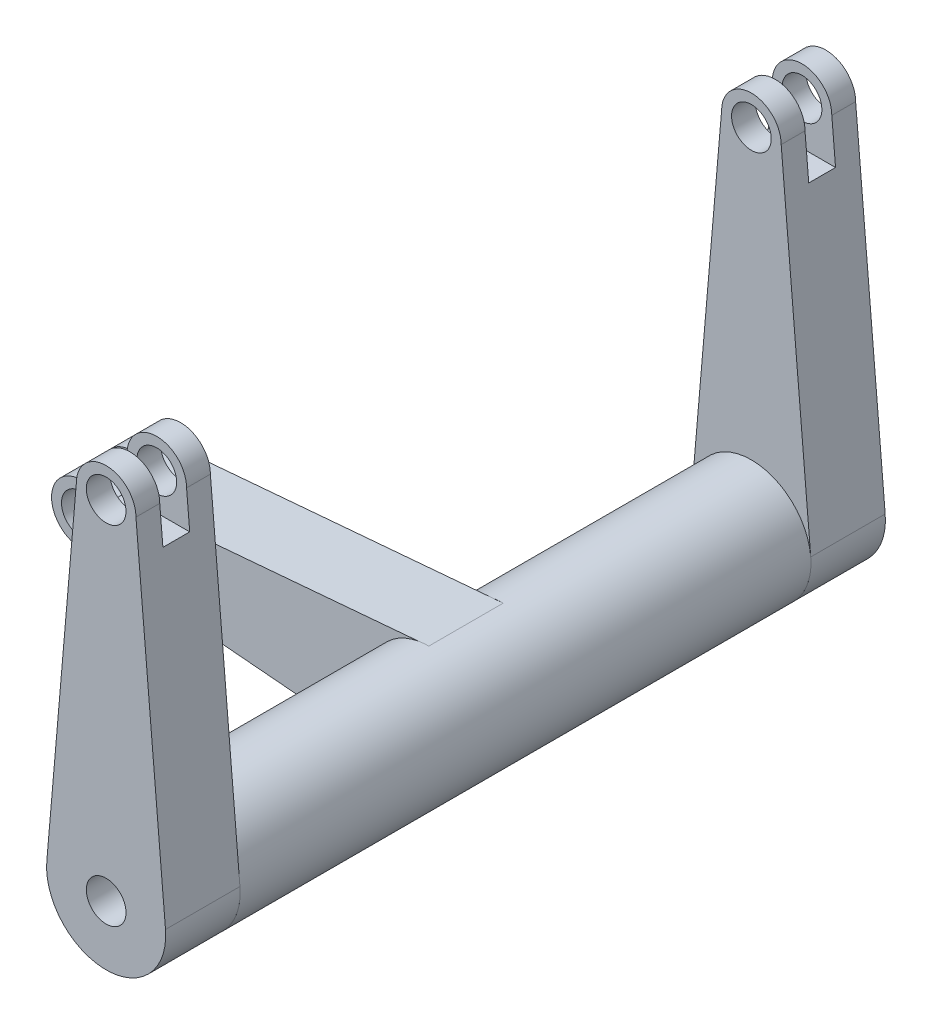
from build123d import *
from build123d.topology import SkipClean

# Parameters (mm, degrees)
SKETCH1_R               = 5.08
EXTRUDE1_DEPTH          = 9.525
CUT_EXTRUDE1_DEPTH      = 6.35
CUT_EXTRUDE1_DEPTH_BACK = 19.05
SKETCH3_W               = 6.858
SKETCH3_H               = 25.4
EXTRUDE2_START          = 63.5
SKETCH4_R               = 15.24
EXTRUDE2_DEPTH          = 63.5
SKETCH5_R               = 15.24
EXTRUDE3_DEPTH          = 63.5
EXTRUDE4_DEPTH          = 19.05
EXTRUDE5_START          = 19.05
EXTRUDE5_DEPTH          = 19.05
SKETCH9_R               = 5.08
EXTRUDE6_DEPTH          = 282.814247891
SKETCH10_R              = 5.08
EXTRUDE7_DEPTH          = 282.814247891
SKETCH11_W              = 6.858
SKETCH11_H              = 25.4
EXTRUDE9_DEPTH          = 233.348560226


with BuildPart() as part:
    # Sketch1 → Extrude1 (new, symmetric)
    with BuildSketch(Plane.XY):
        with BuildLine():
            Line((0, -163.319773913), (88.9, -155.699773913))
            ThreePointArc((88.9, -155.699773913), (104.14, -170.939773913), (88.9, -186.179773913))
            Line((88.9, -186.179773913), (0, -178.559773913))
            ThreePointArc((0, -178.559773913), (-7.62, -170.939773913), (0, -163.319773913))
        make_face()
        with Locations(Location((0, -170.939773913, 0), (0, 0, 180))):
            Circle(SKETCH1_R, mode=Mode.SUBTRACT)
    extrude(amount=EXTRUDE1_DEPTH, both=True)

    # Sketch3 → Cut-Extrude1 (cut, two sides: drawn at the far end of the back side and taken through both)
    with BuildSketch(Plane(origin=(0, 0, 0), x_dir=(0, 0, -1), z_dir=(1, 0, 0)).offset(-CUT_EXTRUDE1_DEPTH_BACK)):
        with Locations((0, -170.757189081)):
            Rectangle(SKETCH3_W, SKETCH3_H)
    extrude(amount=CUT_EXTRUDE1_DEPTH + CUT_EXTRUDE1_DEPTH_BACK, mode=Mode.SUBTRACT)

    # Sketch4 → Extrude2 (add)
    with SkipClean():  # the faces are left unmerged after this step: merging them gives an invalid solid
        with BuildSketch(Plane.XY.offset(9.525).offset(EXTRUDE2_START)):
            with Locations(Location((88.9, -170.939773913, 0), (0, 0, 260.201815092))):
                Circle(SKETCH4_R)
        extrude(amount=-EXTRUDE2_DEPTH)

    # Sketch5 → Extrude3 (add)
    with SkipClean():  # the faces are left unmerged after this step: merging them gives an invalid solid
        with BuildSketch(Plane(origin=(0, 0, -9.525), x_dir=(-1, 0, 0), z_dir=(0, 0, -1))):
            with Locations((-88.9, -170.939773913)):
                Circle(SKETCH5_R)
        extrude(amount=EXTRUDE3_DEPTH)

    # Sketch7 → Extrude4 (add)
    with SkipClean():  # the faces are left unmerged after this step: merging them gives an invalid solid
        with BuildSketch(Plane.XY.offset(73.025)):
            with BuildLine():
                Line((81.28, -82.039773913), (73.71672728, -169.628703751))
                ThreePointArc((73.71672728, -169.628703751), (88.9, -186.179546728), (104.08327272, -169.628703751))
                Line((104.08327272, -169.628703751), (96.52, -82.039773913))
                ThreePointArc((96.52, -82.039773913), (88.9, -74.419773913), (81.28, -82.039773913))
            make_face()
        extrude(amount=EXTRUDE4_DEPTH)

    # Sketch8 → Extrude5 (add)
    with SkipClean():  # the faces are left unmerged after this step: merging them gives an invalid solid
        with BuildSketch(Plane(origin=(0, 0, -73.025), x_dir=(-1, 0, 0), z_dir=(0, 0, -1)).offset(EXTRUDE5_START)):
            with BuildLine():
                Line((-73.71672728, -169.628703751), (-81.28, -82.039773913))
                ThreePointArc((-81.28, -82.039773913), (-88.9, -74.419773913), (-96.52, -82.039773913))
                Line((-96.52, -82.039773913), (-104.08327272, -169.628703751))
                ThreePointArc((-104.08327272, -169.628703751), (-88.9, -186.179546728), (-73.71672728, -169.628703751))
            make_face()
        extrude(amount=-EXTRUDE5_DEPTH)

    # Sketch9 → Extrude6 (cut, through all)
    with SkipClean():  # the faces are left unmerged after this step: merging them gives an invalid solid
        with BuildSketch(Plane(origin=(0, 0, -92.075), x_dir=(-1, 0, 0), z_dir=(0, 0, -1))):
            with Locations((-88.9, -82.039773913)):
                Circle(SKETCH9_R)
        extrude(amount=-EXTRUDE6_DEPTH, mode=Mode.SUBTRACT)

    # Sketch10 → Extrude7 (cut, through all)
    with SkipClean():  # the faces are left unmerged after this step: merging them gives an invalid solid
        with BuildSketch(Plane(origin=(0, 0, -92.075), x_dir=(-1, 0, 0), z_dir=(0, 0, -1))):
            with Locations((-88.9, -170.939773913)):
                Circle(SKETCH10_R)
        extrude(amount=-EXTRUDE7_DEPTH, mode=Mode.SUBTRACT)

    # Sketch11 → Extrude9 (cut, through all)
    with SkipClean():  # the faces are left unmerged after this step: merging them gives an invalid solid
        with BuildSketch(Plane(origin=(0, 0, 0), x_dir=(0, 0, -1), z_dir=(1, 0, 0))):
            with Locations((-82.55, -78.676033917)):
                Rectangle(SKETCH11_W, SKETCH11_H)
            with Locations((82.55, -80.406885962)):
                Rectangle(SKETCH11_W, SKETCH11_H)
        extrude(amount=EXTRUDE9_DEPTH, mode=Mode.SUBTRACT)


solid = part.part
